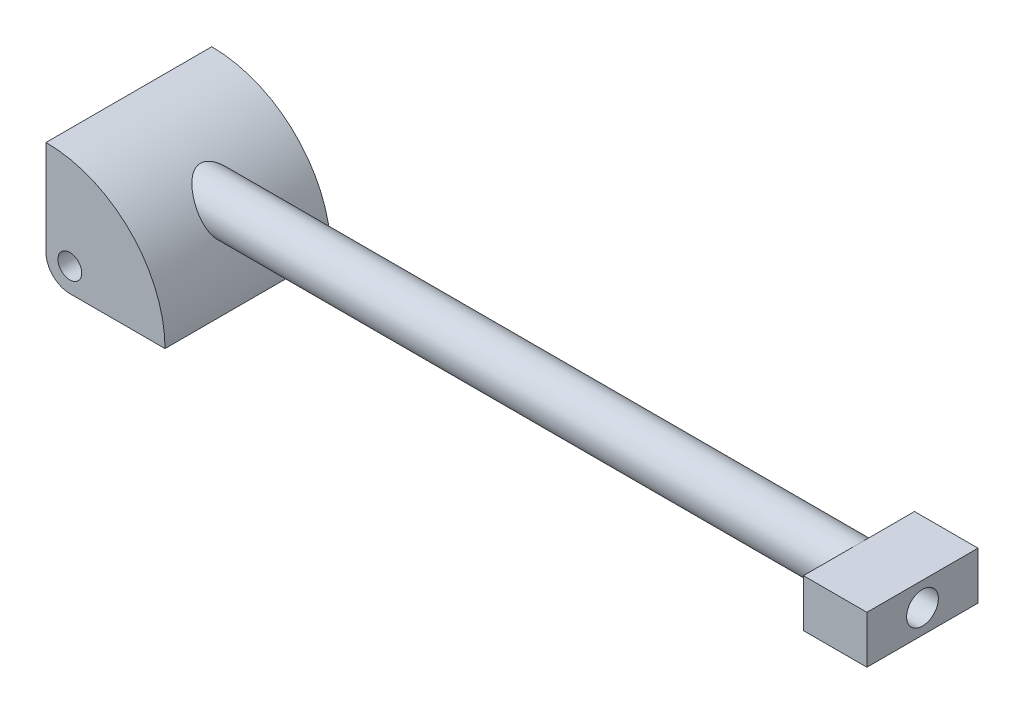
ISO-10303-21;
HEADER;
FILE_DESCRIPTION(('STEP AP214'),'2;1');
FILE_NAME('part.step','',(''),(''),'','','');
FILE_SCHEMA(('AUTOMOTIVE_DESIGN { 1 0 10303 214 1 1 1 1 }'));
ENDSEC;
DATA;
#1=APPLICATION_CONTEXT('core data for automotive mechanical design processes');
#2=APPLICATION_PROTOCOL_DEFINITION('international standard','automotive_design',2000,#1);
#3=PRODUCT_CONTEXT('',#1,'mechanical');
#4=PRODUCT('Part','Part','',(#3));
#5=PRODUCT_RELATED_PRODUCT_CATEGORY('part','',(#4));
#6=PRODUCT_DEFINITION_FORMATION('','',#4);
#7=PRODUCT_DEFINITION_CONTEXT('part definition',#1,'design');
#8=PRODUCT_DEFINITION('design','',#6,#7);
#9=PRODUCT_DEFINITION_SHAPE('','',#8);
#10=(LENGTH_UNIT() NAMED_UNIT(*) SI_UNIT(.MILLI.,.METRE.));
#11=(NAMED_UNIT(*) PLANE_ANGLE_UNIT() SI_UNIT($,.RADIAN.));
#12=(NAMED_UNIT(*) SI_UNIT($,.STERADIAN.) SOLID_ANGLE_UNIT());
#13=UNCERTAINTY_MEASURE_WITH_UNIT(LENGTH_MEASURE(1.E-05),#10,'distance_accuracy_value','');
#14=(GEOMETRIC_REPRESENTATION_CONTEXT(3) GLOBAL_UNCERTAINTY_ASSIGNED_CONTEXT((#13)) GLOBAL_UNIT_ASSIGNED_CONTEXT((#10,
#11,#12)) REPRESENTATION_CONTEXT('',''));
#15=CARTESIAN_POINT('',(0.,0.,0.));
#16=DIRECTION('',(0.,0.,1.));
#17=DIRECTION('',(1.,0.,0.));
#18=AXIS2_PLACEMENT_3D('',#15,#16,#17);
#19=CARTESIAN_POINT('',(615.95,38.1,-66.3321));
#20=DIRECTION('',(-1.,0.,0.));
#21=DIRECTION('',(0.,0.,1.));
#22=AXIS2_PLACEMENT_3D('',#19,#20,#21);
#23=CYLINDRICAL_SURFACE('',#22,19.05);
#24=CARTESIAN_POINT('',(57.1500000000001,38.1,-47.2821));
#25=CARTESIAN_POINT('',(57.637463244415,37.4500465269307,-47.2821025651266));
#26=CARTESIAN_POINT('',(58.1166334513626,36.7937865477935,-47.3153611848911));
#27=CARTESIAN_POINT('',(59.0549006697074,35.4737842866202,-47.4523218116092));
#28=CARTESIAN_POINT('',(59.5139889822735,34.8100389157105,-47.5560540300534));
#29=CARTESIAN_POINT('',(60.4080929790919,33.4820266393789,-47.8378552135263));
#30=CARTESIAN_POINT('',(60.8431158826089,32.8177599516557,-48.0159017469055));
#31=CARTESIAN_POINT('',(61.4745021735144,31.8275078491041,-48.341016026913));
#32=CARTESIAN_POINT('',(61.6814120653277,31.4984941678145,-48.4590409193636));
#33=CARTESIAN_POINT('',(62.087873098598,30.8434518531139,-48.7148175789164));
#34=CARTESIAN_POINT('',(62.287422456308,30.51742395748,-48.8525740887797));
#35=CARTESIAN_POINT('',(62.7629612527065,29.7300659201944,-49.2117572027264));
#36=CARTESIAN_POINT('',(63.0348347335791,29.2709733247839,-49.4436583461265));
#37=CARTESIAN_POINT('',(63.5610341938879,28.3657529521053,-49.9487086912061));
#38=CARTESIAN_POINT('',(63.8153641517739,27.9196222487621,-50.221848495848));
#39=CARTESIAN_POINT('',(64.3051838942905,27.0447608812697,-50.8091636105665));
#40=CARTESIAN_POINT('',(64.5406851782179,26.6160196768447,-51.1233135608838));
#41=CARTESIAN_POINT('',(64.9919109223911,25.7801831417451,-51.7921177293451));
#42=CARTESIAN_POINT('',(65.2076347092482,25.3730885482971,-52.1467733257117));
#43=CARTESIAN_POINT('',(65.6194560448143,24.5830754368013,-52.8973057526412));
#44=CARTESIAN_POINT('',(65.8154398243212,24.2003012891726,-53.2933973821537));
#45=CARTESIAN_POINT('',(66.185619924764,23.4661226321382,-54.1231287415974));
#46=CARTESIAN_POINT('',(66.3598159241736,23.1147185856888,-54.556769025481));
#47=CARTESIAN_POINT('',(66.685765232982,22.4479376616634,-55.4587407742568));
#48=CARTESIAN_POINT('',(66.8375212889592,22.132556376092,-55.9270679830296));
#49=CARTESIAN_POINT('',(67.1181511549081,21.5421070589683,-56.8949425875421));
#50=CARTESIAN_POINT('',(67.2470272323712,21.2670350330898,-57.3944868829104));
#51=CARTESIAN_POINT('',(67.4704326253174,20.7851718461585,-58.3717494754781));
#52=CARTESIAN_POINT('',(67.5670639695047,20.5743729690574,-58.8470165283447));
#53=CARTESIAN_POINT('',(67.7412349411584,20.1914109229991,-59.8162431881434));
#54=CARTESIAN_POINT('',(67.8187757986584,20.019245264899,-60.3102015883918));
#55=CARTESIAN_POINT('',(67.9546805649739,19.7156516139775,-61.3128818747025));
#56=CARTESIAN_POINT('',(68.0130504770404,19.5842108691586,-61.8215990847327));
#57=CARTESIAN_POINT('',(68.1106214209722,19.3635804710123,-62.8499198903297));
#58=CARTESIAN_POINT('',(68.1498230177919,19.2743895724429,-63.3695231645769));
#59=CARTESIAN_POINT('',(68.2073909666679,19.1431280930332,-64.3860212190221));
#60=CARTESIAN_POINT('',(68.2268034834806,19.0986932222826,-64.8825531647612));
#61=CARTESIAN_POINT('',(68.2485525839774,19.0488972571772,-65.8779321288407));
#62=CARTESIAN_POINT('',(68.2508899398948,19.0435343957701,-66.3767790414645));
#63=CARTESIAN_POINT('',(68.2384911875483,19.0719364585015,-67.3730727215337));
#64=CARTESIAN_POINT('',(68.223757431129,19.1056959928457,-67.870519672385));
#65=CARTESIAN_POINT('',(68.1772185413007,19.2119680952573,-68.8604512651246));
#66=CARTESIAN_POINT('',(68.1454133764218,19.2844807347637,-69.3529358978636));
#67=CARTESIAN_POINT('',(68.0653080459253,19.4661692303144,-70.3224146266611));
#68=CARTESIAN_POINT('',(68.0172492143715,19.5748083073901,-70.7995294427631));
#69=CARTESIAN_POINT('',(67.904558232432,19.8278402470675,-71.7421665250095));
#70=CARTESIAN_POINT('',(67.8399263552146,19.9722325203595,-72.2076889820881));
#71=CARTESIAN_POINT('',(67.694128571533,20.2952669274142,-73.1240050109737));
#72=CARTESIAN_POINT('',(67.6129631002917,20.4739081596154,-73.5747989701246));
#73=CARTESIAN_POINT('',(67.4341739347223,20.8636077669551,-74.4587602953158));
#74=CARTESIAN_POINT('',(67.3365499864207,21.0746666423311,-74.891927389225));
#75=CARTESIAN_POINT('',(67.1232463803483,21.5307649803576,-75.7448916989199));
#76=CARTESIAN_POINT('',(67.0072977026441,21.7763034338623,-76.1643546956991));
#77=CARTESIAN_POINT('',(66.7587505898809,22.2961459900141,-76.979847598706));
#78=CARTESIAN_POINT('',(66.6261520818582,22.5704502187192,-77.3758774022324));
#79=CARTESIAN_POINT('',(66.3445938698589,23.1451204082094,-78.1424155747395));
#80=CARTESIAN_POINT('',(66.1956329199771,23.4454883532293,-78.5129219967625));
#81=CARTESIAN_POINT('',(65.8817510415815,24.0693934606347,-79.2266442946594));
#82=CARTESIAN_POINT('',(65.7168296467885,24.3929312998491,-79.5698593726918));
#83=CARTESIAN_POINT('',(65.3624696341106,25.0776977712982,-80.2448715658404));
#84=CARTESIAN_POINT('',(65.1721994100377,25.4400129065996,-80.5751297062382));
#85=CARTESIAN_POINT('',(64.7752077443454,26.1835567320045,-81.2027967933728));
#86=CARTESIAN_POINT('',(64.5684858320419,26.5647859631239,-81.5002047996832));
#87=CARTESIAN_POINT('',(64.1393438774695,27.3428112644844,-82.061548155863));
#88=CARTESIAN_POINT('',(63.9169213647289,27.7396097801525,-82.3254782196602));
#89=CARTESIAN_POINT('',(63.4572610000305,28.5454789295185,-82.8195824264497));
#90=CARTESIAN_POINT('',(63.2200214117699,28.9545509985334,-83.0497526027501));
#91=CARTESIAN_POINT('',(62.7069692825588,29.8237162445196,-83.4980044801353));
#92=CARTESIAN_POINT('',(62.4296823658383,30.284784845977,-83.7125084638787));
#93=CARTESIAN_POINT('',(61.8596197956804,31.2142339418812,-84.1012456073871));
#94=CARTESIAN_POINT('',(61.5668432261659,31.6826148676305,-84.2754763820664));
#95=CARTESIAN_POINT('',(60.9670505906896,32.6234501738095,-84.5846392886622));
#96=CARTESIAN_POINT('',(60.6600289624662,33.0959060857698,-84.7195559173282));
#97=CARTESIAN_POINT('',(60.0332097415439,34.0417171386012,-84.951174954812));
#98=CARTESIAN_POINT('',(59.7134108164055,34.5150723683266,-85.0478733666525));
#99=CARTESIAN_POINT('',(59.0119364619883,35.5332901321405,-85.2164976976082));
#100=CARTESIAN_POINT('',(58.628353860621,36.0778628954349,-85.2822599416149));
#101=CARTESIAN_POINT('',(57.8480515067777,37.1611909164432,-85.3667106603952));
#102=CARTESIAN_POINT('',(57.4513305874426,37.6999456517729,-85.385394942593));
#103=CARTESIAN_POINT('',(56.6467585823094,38.7687745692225,-85.3778574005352));
#104=CARTESIAN_POINT('',(56.2389067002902,39.2988481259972,-85.3516323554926));
#105=CARTESIAN_POINT('',(55.4140753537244,40.3478901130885,-85.2563417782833));
#106=CARTESIAN_POINT('',(54.9970954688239,40.8668580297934,-85.1872742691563));
#107=CARTESIAN_POINT('',(54.077379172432,41.9874277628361,-84.9914552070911));
#108=CARTESIAN_POINT('',(53.5731667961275,42.5863674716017,-84.8563414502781));
#109=CARTESIAN_POINT('',(52.5578218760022,43.7631078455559,-84.5311229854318));
#110=CARTESIAN_POINT('',(52.04668848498,44.3409058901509,-84.3410114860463));
#111=CARTESIAN_POINT('',(51.0196000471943,45.4744136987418,-83.9073573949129));
#112=CARTESIAN_POINT('',(50.5036362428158,46.030065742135,-83.663684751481));
#113=CARTESIAN_POINT('',(49.4717378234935,47.1156620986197,-83.1245875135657));
#114=CARTESIAN_POINT('',(48.955803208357,47.6456066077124,-82.8291633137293));
#115=CARTESIAN_POINT('',(47.8531516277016,48.7528508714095,-82.1404570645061));
#116=CARTESIAN_POINT('',(47.2670562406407,49.3258245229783,-81.7391912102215));
#117=CARTESIAN_POINT('',(46.1069457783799,50.4322067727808,-80.8687754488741));
#118=CARTESIAN_POINT('',(45.5329366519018,50.9655961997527,-80.3995929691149));
#119=CARTESIAN_POINT('',(44.6894285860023,51.7312961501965,-79.6444280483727));
#120=CARTESIAN_POINT('',(44.4115821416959,51.9804493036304,-79.3845709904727));
#121=CARTESIAN_POINT('',(43.8627897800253,52.466974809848,-78.847050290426));
#122=CARTESIAN_POINT('',(43.5918439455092,52.7043470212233,-78.5693864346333));
#123=CARTESIAN_POINT('',(43.058881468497,53.1661586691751,-77.9960916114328));
#124=CARTESIAN_POINT('',(42.7968554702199,53.3906118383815,-77.7004804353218));
#125=CARTESIAN_POINT('',(42.2834629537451,53.8257986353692,-77.0904518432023));
#126=CARTESIAN_POINT('',(42.0320961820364,54.0365325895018,-76.7760348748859));
#127=CARTESIAN_POINT('',(41.5526453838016,54.4345213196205,-76.1412965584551));
#128=CARTESIAN_POINT('',(41.3240278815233,54.622387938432,-75.8217638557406));
#129=CARTESIAN_POINT('',(40.8813918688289,54.982913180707,-75.1644408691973));
#130=CARTESIAN_POINT('',(40.6673735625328,55.1555715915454,-74.8266503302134));
#131=CARTESIAN_POINT('',(40.257228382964,55.483778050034,-74.1329845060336));
#132=CARTESIAN_POINT('',(40.0610799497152,55.6393467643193,-73.7771318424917));
#133=CARTESIAN_POINT('',(39.6898965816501,55.931616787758,-73.0470447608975));
#134=CARTESIAN_POINT('',(39.5148600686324,56.0683195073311,-72.6728117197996));
#135=CARTESIAN_POINT('',(39.2171243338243,56.2994132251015,-71.9709408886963));
#136=CARTESIAN_POINT('',(39.0905705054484,56.3970555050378,-71.6460106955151));
#137=CARTESIAN_POINT('',(38.8573163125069,56.5762312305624,-70.9849030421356));
#138=CARTESIAN_POINT('',(38.7506061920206,56.6577725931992,-70.6487312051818));
#139=CARTESIAN_POINT('',(38.5594529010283,56.8033314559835,-69.96657721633));
#140=CARTESIAN_POINT('',(38.4749967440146,56.8673591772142,-69.6206009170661));
#141=CARTESIAN_POINT('',(38.3304939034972,56.9766378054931,-68.9206298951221));
#142=CARTESIAN_POINT('',(38.2704469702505,57.0218889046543,-68.5666352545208));
#143=CARTESIAN_POINT('',(38.1761985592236,57.0928147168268,-67.850597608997));
#144=CARTESIAN_POINT('',(38.1421883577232,57.1183445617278,-67.488514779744));
#145=CARTESIAN_POINT('',(38.101844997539,57.1486204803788,-66.7619299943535));
#146=CARTESIAN_POINT('',(38.0955117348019,57.1533666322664,-66.397428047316));
#147=CARTESIAN_POINT('',(38.1107339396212,57.1419489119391,-65.6693327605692));
#148=CARTESIAN_POINT('',(38.1322903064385,57.125784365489,-65.3057394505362));
#149=CARTESIAN_POINT('',(38.2025805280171,57.0729691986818,-64.5827214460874));
#150=CARTESIAN_POINT('',(38.2513135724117,57.0363191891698,-64.2232966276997));
#151=CARTESIAN_POINT('',(38.367751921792,56.9484798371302,-63.5500490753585));
#152=CARTESIAN_POINT('',(38.4328323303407,56.8992939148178,-63.2355017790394));
#153=CARTESIAN_POINT('',(38.5819320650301,56.7862159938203,-62.6135278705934));
#154=CARTESIAN_POINT('',(38.6659580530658,56.722318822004,-62.3061038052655));
#155=CARTESIAN_POINT('',(38.8512478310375,56.5808241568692,-61.6997602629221));
#156=CARTESIAN_POINT('',(38.952511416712,56.503226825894,-61.4008406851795));
#157=CARTESIAN_POINT('',(39.1705229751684,56.3353576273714,-60.8123244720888));
#158=CARTESIAN_POINT('',(39.2872748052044,56.2450826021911,-60.5227301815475));
#159=CARTESIAN_POINT('',(39.604523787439,55.9984468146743,-59.7922641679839));
#160=CARTESIAN_POINT('',(39.8150147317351,55.8336045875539,-59.3585569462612));
#161=CARTESIAN_POINT('',(40.2635003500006,55.4788733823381,-58.5163262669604));
#162=CARTESIAN_POINT('',(40.5015083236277,55.2889722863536,-58.1078151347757));
#163=CARTESIAN_POINT('',(41.0002433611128,54.8866865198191,-57.3150215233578));
#164=CARTESIAN_POINT('',(41.2610239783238,54.6742485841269,-56.9308000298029));
#165=CARTESIAN_POINT('',(41.8003113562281,54.2297677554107,-56.1871134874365));
#166=CARTESIAN_POINT('',(42.0788177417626,53.9977252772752,-55.8276479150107));
#167=CARTESIAN_POINT('',(42.7958078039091,53.3929184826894,-54.9550410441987));
#168=CARTESIAN_POINT('',(43.2433568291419,53.0088048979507,-54.457165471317));
#169=CARTESIAN_POINT('',(44.1608746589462,52.2053182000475,-53.5130947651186));
#170=CARTESIAN_POINT('',(44.630854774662,51.7859272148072,-53.0669261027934));
#171=CARTESIAN_POINT('',(45.5863960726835,50.9151137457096,-52.2238410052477));
#172=CARTESIAN_POINT('',(46.0719748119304,50.4636544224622,-51.8269827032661));
#173=CARTESIAN_POINT('',(47.0524371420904,49.5319780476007,-51.0819173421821));
#174=CARTESIAN_POINT('',(47.5473191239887,49.0517659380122,-50.7337019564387));
#175=CARTESIAN_POINT('',(48.5613532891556,48.0454344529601,-50.0727275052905));
#176=CARTESIAN_POINT('',(49.0806993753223,47.5182551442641,-49.7618805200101));
#177=CARTESIAN_POINT('',(50.1204409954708,46.4372137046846,-49.192479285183));
#178=CARTESIAN_POINT('',(50.6408366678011,45.883347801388,-48.9339324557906));
#179=CARTESIAN_POINT('',(51.6775798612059,44.752499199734,-48.4709946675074));
#180=CARTESIAN_POINT('',(52.1939341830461,44.1755765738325,-48.2664723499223));
#181=CARTESIAN_POINT('',(53.2202557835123,42.9998291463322,-47.912792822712));
#182=CARTESIAN_POINT('',(53.7302252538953,42.401012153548,-47.7636160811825));
#183=CARTESIAN_POINT('',(54.7322169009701,41.1941016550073,-47.525158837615));
#184=CARTESIAN_POINT('',(55.2243965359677,40.5863289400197,-47.434921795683));
#185=CARTESIAN_POINT('',(56.1969926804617,39.3543596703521,-47.3133547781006));
#186=CARTESIAN_POINT('',(56.6773939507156,38.7301438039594,-47.2820975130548));
#187=CARTESIAN_POINT('',(57.1500000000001,38.1,-47.2821));
#188=B_SPLINE_CURVE_WITH_KNOTS('',3,(#24,#25,#26,#27,#28,#29,#30,#31,#32,#33,#34,#35,#36,#37,
#38,#39,#40,#41,#42,#43,#44,#45,#46,#47,#48,#49,#50,#51,#52,#53,#54,#55,#56,#57,#58,#59,#60,#61,
#62,#63,#64,#65,#66,#67,#68,#69,#70,#71,#72,#73,#74,#75,#76,#77,#78,#79,#80,#81,#82,#83,#84,#85,
#86,#87,#88,#89,#90,#91,#92,#93,#94,#95,#96,#97,#98,#99,#100,#101,#102,#103,#104,#105,#106,#107,
#108,#109,#110,#111,#112,#113,#114,#115,#116,#117,#118,#119,#120,#121,#122,#123,#124,#125,#126,
#127,#128,#129,#130,#131,#132,#133,#134,#135,#136,#137,#138,#139,#140,#141,#142,#143,#144,#145,
#146,#147,#148,#149,#150,#151,#152,#153,#154,#155,#156,#157,#158,#159,#160,#161,#162,#163,#164,
#165,#166,#167,#168,#169,#170,#171,#172,#173,#174,#175,#176,#177,#178,#179,#180,#181,#182,#183,
#184,#185,#186,#187),.UNSPECIFIED.,.T.,.F.,(4,2,2,2,2,2,2,2,2,2,2,2,2,2,2,2,2,2,2,2,2,2,2,2,2,2,
2,2,2,2,2,2,2,2,2,2,2,2,2,2,2,2,2,2,2,2,2,2,2,2,2,2,2,2,2,2,2,2,2,2,2,2,2,2,2,2,2,2,2,2,2,2,2,2,
2,2,2,2,2,2,2,4),(0.,2.43658157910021,4.87420836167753,7.31109988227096,8.5292041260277,
9.74760165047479,11.4910410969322,13.2340838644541,14.9760538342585,16.7180830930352,
18.4696380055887,20.2212187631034,21.9725849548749,23.7237774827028,25.3082161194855,
26.892552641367,28.476392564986,30.0601858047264,31.5550624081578,33.0498714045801,
34.5444744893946,36.0390803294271,37.5124033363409,38.9857020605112,40.4589620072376,
41.9322446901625,43.4296062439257,44.9269743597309,46.424456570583,47.9219825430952,
49.4979247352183,51.0739120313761,52.6501478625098,54.2265687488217,55.96244521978,
57.6984244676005,59.4350873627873,61.1719318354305,63.1780112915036,65.1842693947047,
67.19067138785,69.1971659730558,71.5782775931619,73.9596833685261,76.3469365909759,
78.7341716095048,81.4686875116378,84.2045192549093,85.5683337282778,86.9321645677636,
88.2945178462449,89.6568387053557,90.9625335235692,92.2682465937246,93.5723628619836,
94.8763815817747,95.9617666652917,97.0466167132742,98.1308322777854,99.2150367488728,
100.307131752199,101.399222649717,102.491348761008,103.583442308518,104.55731331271,
105.531527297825,106.505729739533,107.480175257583,109.006235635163,110.533036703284,
112.063530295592,113.593991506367,115.906016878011,118.219220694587,120.535126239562,
122.850634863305,125.256435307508,127.662576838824,130.062812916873,132.462201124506,
134.821612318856,137.18393031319),.UNSPECIFIED.);
#189=CARTESIAN_POINT('',(57.1500000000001,38.1,-47.2821));
#190=VERTEX_POINT('',#189);
#191=EDGE_CURVE('E187',#190,#190,#188,.T.);
#192=ORIENTED_EDGE('',*,*,#191,.T.);
#193=EDGE_LOOP('',(#192));
#194=FACE_BOUND('',#193,.T.);
#195=CARTESIAN_POINT('',(565.15,38.1,-66.3321));
#196=DIRECTION('',(1.,0.,0.));
#197=DIRECTION('',(0.,0.,-1.));
#198=AXIS2_PLACEMENT_3D('',#195,#196,#197);
#199=CIRCLE('',#198,19.05);
#200=CARTESIAN_POINT('',(565.15,57.15,-66.3321));
#201=VERTEX_POINT('',#200);
#202=CARTESIAN_POINT('',(565.15,19.05,-66.3321));
#203=VERTEX_POINT('',#202);
#204=EDGE_CURVE('E37',#201,#203,#199,.F.);
#205=ORIENTED_EDGE('',*,*,#204,.T.);
#206=EDGE_CURVE('E12',#203,#201,#199,.F.);
#207=ORIENTED_EDGE('',*,*,#206,.T.);
#208=EDGE_LOOP('',(#205,#207));
#209=FACE_BOUND('',#208,.T.);
#210=ADVANCED_FACE('F33',(#194,#209),#23,.T.);
#211=CARTESIAN_POINT('',(0.,0.,-132.6642));
#212=DIRECTION('',(0.,0.,1.));
#213=DIRECTION('',(1.,0.,0.));
#214=AXIS2_PLACEMENT_3D('',#211,#212,#213);
#215=CYLINDRICAL_SURFACE('',#214,19.05);
#216=CARTESIAN_POINT('',(0.,0.,0.));
#217=DIRECTION('',(0.,0.,1.));
#218=DIRECTION('',(1.,0.,0.));
#219=AXIS2_PLACEMENT_3D('',#216,#217,#218);
#220=CIRCLE('',#219,19.05);
#221=CARTESIAN_POINT('',(-19.05,0.,0.));
#222=VERTEX_POINT('',#221);
#223=CARTESIAN_POINT('',(0.,-19.05,0.));
#224=VERTEX_POINT('',#223);
#225=EDGE_CURVE('E163',#222,#224,#220,.T.);
#226=ORIENTED_EDGE('',*,*,#225,.F.);
#227=DIRECTION('',(0.,0.,1.));
#228=VECTOR('',#227,1.);
#229=CARTESIAN_POINT('',(-19.05,0.,-132.6642));
#230=LINE('',#229,#228);
#231=CARTESIAN_POINT('',(-19.05,0.,-132.6642));
#232=VERTEX_POINT('',#231);
#233=EDGE_CURVE('E57',#232,#222,#230,.T.);
#234=ORIENTED_EDGE('',*,*,#233,.F.);
#235=CARTESIAN_POINT('',(0.,0.,-132.6642));
#236=DIRECTION('',(0.,0.,1.));
#237=DIRECTION('',(1.,0.,0.));
#238=AXIS2_PLACEMENT_3D('',#235,#236,#237);
#239=CIRCLE('',#238,19.05);
#240=CARTESIAN_POINT('',(0.,-19.05,-132.6642));
#241=VERTEX_POINT('',#240);
#242=EDGE_CURVE('E166',#232,#241,#239,.T.);
#243=ORIENTED_EDGE('',*,*,#242,.T.);
#244=DIRECTION('',(0.,0.,1.));
#245=VECTOR('',#244,1.);
#246=CARTESIAN_POINT('',(0.,-19.05,-132.6642));
#247=LINE('',#246,#245);
#248=EDGE_CURVE('E83',#241,#224,#247,.T.);
#249=ORIENTED_EDGE('',*,*,#248,.T.);
#250=EDGE_LOOP('',(#226,#234,#243,#249));
#251=FACE_BOUND('',#250,.T.);
#252=ADVANCED_FACE('F35',(#251),#215,.T.);
#253=CARTESIAN_POINT('',(-19.05,0.,-132.6642));
#254=DIRECTION('',(-1.,0.,0.));
#255=DIRECTION('',(0.,0.,1.));
#256=AXIS2_PLACEMENT_3D('',#253,#254,#255);
#257=PLANE('',#256);
#258=DIRECTION('',(0.,-1.,0.));
#259=VECTOR('',#258,1.);
#260=CARTESIAN_POINT('',(-19.05,0.,0.));
#261=LINE('',#260,#259);
#262=CARTESIAN_POINT('',(-19.05,76.2,0.));
#263=VERTEX_POINT('',#262);
#264=EDGE_CURVE('E169',#263,#222,#261,.T.);
#265=ORIENTED_EDGE('',*,*,#264,.F.);
#266=DIRECTION('',(0.,0.,1.));
#267=VECTOR('',#266,1.);
#268=CARTESIAN_POINT('',(-19.05,76.2,-132.6642));
#269=LINE('',#268,#267);
#270=CARTESIAN_POINT('',(-19.05,76.2,-132.6642));
#271=VERTEX_POINT('',#270);
#272=EDGE_CURVE('E188',#271,#263,#269,.T.);
#273=ORIENTED_EDGE('',*,*,#272,.F.);
#274=DIRECTION('',(0.,-1.,0.));
#275=VECTOR('',#274,1.);
#276=CARTESIAN_POINT('',(-19.05,0.,-132.6642));
#277=LINE('',#276,#275);
#278=EDGE_CURVE('E174',#271,#232,#277,.T.);
#279=ORIENTED_EDGE('',*,*,#278,.T.);
#280=ORIENTED_EDGE('',*,*,#233,.T.);
#281=EDGE_LOOP('',(#265,#273,#279,#280));
#282=FACE_BOUND('',#281,.T.);
#283=ADVANCED_FACE('F219',(#282),#257,.T.);
#284=CARTESIAN_POINT('',(-19.05,-19.05,-132.6642));
#285=DIRECTION('',(0.,0.,1.));
#286=DIRECTION('',(1.,0.,0.));
#287=AXIS2_PLACEMENT_3D('',#284,#285,#286);
#288=CYLINDRICAL_SURFACE('',#287,95.25);
#289=ORIENTED_EDGE('',*,*,#191,.F.);
#290=EDGE_LOOP('',(#289));
#291=FACE_BOUND('',#290,.T.);
#292=CARTESIAN_POINT('',(-19.05,-19.05,0.));
#293=DIRECTION('',(0.,0.,1.));
#294=DIRECTION('',(-1.,0.,0.));
#295=AXIS2_PLACEMENT_3D('',#292,#293,#294);
#296=CIRCLE('',#295,95.25);
#297=CARTESIAN_POINT('',(76.2,-19.05,0.));
#298=VERTEX_POINT('',#297);
#299=EDGE_CURVE('E181',#298,#263,#296,.T.);
#300=ORIENTED_EDGE('',*,*,#299,.F.);
#301=DIRECTION('',(0.,0.,1.));
#302=VECTOR('',#301,1.);
#303=CARTESIAN_POINT('',(76.2,-19.05,-132.6642));
#304=LINE('',#303,#302);
#305=CARTESIAN_POINT('',(76.2,-19.05,-132.6642));
#306=VERTEX_POINT('',#305);
#307=EDGE_CURVE('E190',#306,#298,#304,.T.);
#308=ORIENTED_EDGE('',*,*,#307,.F.);
#309=CARTESIAN_POINT('',(-19.05,-19.05,-132.6642));
#310=DIRECTION('',(0.,0.,1.));
#311=DIRECTION('',(-1.,0.,0.));
#312=AXIS2_PLACEMENT_3D('',#309,#310,#311);
#313=CIRCLE('',#312,95.25);
#314=EDGE_CURVE('E171',#306,#271,#313,.T.);
#315=ORIENTED_EDGE('',*,*,#314,.T.);
#316=ORIENTED_EDGE('',*,*,#272,.T.);
#317=EDGE_LOOP('',(#300,#308,#315,#316));
#318=FACE_BOUND('',#317,.T.);
#319=ADVANCED_FACE('F197',(#291,#318),#288,.T.);
#320=CARTESIAN_POINT('',(0.,-19.05,-132.6642));
#321=DIRECTION('',(0.,-1.,0.));
#322=DIRECTION('',(0.,0.,-1.));
#323=AXIS2_PLACEMENT_3D('',#320,#321,#322);
#324=PLANE('',#323);
#325=DIRECTION('',(1.,0.,0.));
#326=VECTOR('',#325,1.);
#327=CARTESIAN_POINT('',(0.,-19.05,0.));
#328=LINE('',#327,#326);
#329=EDGE_CURVE('E178',#224,#298,#328,.T.);
#330=ORIENTED_EDGE('',*,*,#329,.F.);
#331=ORIENTED_EDGE('',*,*,#248,.F.);
#332=DIRECTION('',(1.,0.,0.));
#333=VECTOR('',#332,1.);
#334=CARTESIAN_POINT('',(0.,-19.05,-132.6642));
#335=LINE('',#334,#333);
#336=EDGE_CURVE('E168',#241,#306,#335,.T.);
#337=ORIENTED_EDGE('',*,*,#336,.T.);
#338=ORIENTED_EDGE('',*,*,#307,.T.);
#339=EDGE_LOOP('',(#330,#331,#337,#338));
#340=FACE_BOUND('',#339,.T.);
#341=ADVANCED_FACE('F215',(#340),#324,.T.);
#342=CARTESIAN_POINT('',(0.,0.,-132.6642));
#343=DIRECTION('',(0.,0.,1.));
#344=DIRECTION('',(1.,0.,0.));
#345=AXIS2_PLACEMENT_3D('',#342,#343,#344);
#346=PLANE('',#345);
#347=CARTESIAN_POINT('',(0.,0.,-132.6642));
#348=DIRECTION('',(0.,0.,1.));
#349=DIRECTION('',(1.,0.,0.));
#350=AXIS2_PLACEMENT_3D('',#347,#348,#349);
#351=CIRCLE('',#350,9.525);
#352=CARTESIAN_POINT('',(9.525,0.,-132.6642));
#353=VERTEX_POINT('',#352);
#354=EDGE_CURVE('E160',#353,#353,#351,.T.);
#355=ORIENTED_EDGE('',*,*,#354,.T.);
#356=EDGE_LOOP('',(#355));
#357=FACE_BOUND('',#356,.T.);
#358=ORIENTED_EDGE('',*,*,#242,.F.);
#359=ORIENTED_EDGE('',*,*,#278,.F.);
#360=ORIENTED_EDGE('',*,*,#314,.F.);
#361=ORIENTED_EDGE('',*,*,#336,.F.);
#362=EDGE_LOOP('',(#358,#359,#360,#361));
#363=FACE_BOUND('',#362,.T.);
#364=ADVANCED_FACE('F212',(#357,#363),#346,.F.);
#365=CARTESIAN_POINT('',(0.,0.,0.));
#366=DIRECTION('',(0.,0.,1.));
#367=DIRECTION('',(1.,0.,0.));
#368=AXIS2_PLACEMENT_3D('',#365,#366,#367);
#369=PLANE('',#368);
#370=CARTESIAN_POINT('',(0.,0.,0.));
#371=DIRECTION('',(0.,0.,1.));
#372=DIRECTION('',(1.,0.,0.));
#373=AXIS2_PLACEMENT_3D('',#370,#371,#372);
#374=CIRCLE('',#373,9.525);
#375=CARTESIAN_POINT('',(9.525,0.,0.));
#376=VERTEX_POINT('',#375);
#377=EDGE_CURVE('E155',#376,#376,#374,.T.);
#378=ORIENTED_EDGE('',*,*,#377,.F.);
#379=EDGE_LOOP('',(#378));
#380=FACE_BOUND('',#379,.T.);
#381=ORIENTED_EDGE('',*,*,#225,.T.);
#382=ORIENTED_EDGE('',*,*,#329,.T.);
#383=ORIENTED_EDGE('',*,*,#299,.T.);
#384=ORIENTED_EDGE('',*,*,#264,.T.);
#385=EDGE_LOOP('',(#381,#382,#383,#384));
#386=FACE_BOUND('',#385,.T.);
#387=ADVANCED_FACE('F210',(#380,#386),#369,.T.);
#388=CARTESIAN_POINT('',(0.,0.,-132.6642));
#389=DIRECTION('',(0.,0.,1.));
#390=DIRECTION('',(1.,0.,0.));
#391=AXIS2_PLACEMENT_3D('',#388,#389,#390);
#392=CYLINDRICAL_SURFACE('',#391,9.525);
#393=ORIENTED_EDGE('',*,*,#354,.F.);
#394=EDGE_LOOP('',(#393));
#395=FACE_BOUND('',#394,.T.);
#396=ORIENTED_EDGE('',*,*,#377,.T.);
#397=EDGE_LOOP('',(#396));
#398=FACE_BOUND('',#397,.T.);
#399=ADVANCED_FACE('F207',(#395,#398),#392,.F.);
#400=CARTESIAN_POINT('',(565.15,19.05,-21.8821));
#401=DIRECTION('',(1.,0.,0.));
#402=DIRECTION('',(0.,0.,-1.));
#403=AXIS2_PLACEMENT_3D('',#400,#401,#402);
#404=PLANE('',#403);
#405=ORIENTED_EDGE('',*,*,#206,.F.);
#406=DIRECTION('',(0.,0.,-1.));
#407=VECTOR('',#406,1.);
#408=CARTESIAN_POINT('',(565.15,19.05,-21.8821));
#409=LINE('',#408,#407);
#410=CARTESIAN_POINT('',(565.15,19.05,-21.8821));
#411=VERTEX_POINT('',#410);
#412=EDGE_CURVE('E48',#411,#203,#409,.T.);
#413=ORIENTED_EDGE('',*,*,#412,.F.);
#414=DIRECTION('',(0.,-1.,0.));
#415=VECTOR('',#414,1.);
#416=CARTESIAN_POINT('',(565.15,57.15,-21.8821));
#417=LINE('',#416,#415);
#418=CARTESIAN_POINT('',(565.15,57.15,-21.8821));
#419=VERTEX_POINT('',#418);
#420=EDGE_CURVE('E127',#419,#411,#417,.T.);
#421=ORIENTED_EDGE('',*,*,#420,.F.);
#422=DIRECTION('',(0.,0.,1.));
#423=VECTOR('',#422,1.);
#424=CARTESIAN_POINT('',(565.15,57.15,-21.8821));
#425=LINE('',#424,#423);
#426=EDGE_CURVE('E146',#201,#419,#425,.T.);
#427=ORIENTED_EDGE('',*,*,#426,.F.);
#428=EDGE_LOOP('',(#405,#413,#421,#427));
#429=FACE_BOUND('',#428,.T.);
#430=ADVANCED_FACE('F125',(#429),#404,.F.);
#431=CARTESIAN_POINT('',(565.15,57.15,-21.8821));
#432=DIRECTION('',(0.,1.,0.));
#433=DIRECTION('',(0.,0.,1.));
#434=AXIS2_PLACEMENT_3D('',#431,#432,#433);
#435=PLANE('',#434);
#436=DIRECTION('',(0.,0.,1.));
#437=VECTOR('',#436,1.);
#438=CARTESIAN_POINT('',(615.95,57.15,-21.8821));
#439=LINE('',#438,#437);
#440=CARTESIAN_POINT('',(615.95,57.15,-110.7821));
#441=VERTEX_POINT('',#440);
#442=CARTESIAN_POINT('',(615.95,57.15,-21.8821));
#443=VERTEX_POINT('',#442);
#444=EDGE_CURVE('E136',#441,#443,#439,.T.);
#445=ORIENTED_EDGE('',*,*,#444,.F.);
#446=DIRECTION('',(1.,0.,0.));
#447=VECTOR('',#446,1.);
#448=CARTESIAN_POINT('',(565.15,57.15,-110.7821));
#449=LINE('',#448,#447);
#450=CARTESIAN_POINT('',(565.15,57.15,-110.7821));
#451=VERTEX_POINT('',#450);
#452=EDGE_CURVE('E156',#451,#441,#449,.T.);
#453=ORIENTED_EDGE('',*,*,#452,.F.);
#454=EDGE_CURVE('E120',#451,#201,#425,.T.);
#455=ORIENTED_EDGE('',*,*,#454,.T.);
#456=ORIENTED_EDGE('',*,*,#426,.T.);
#457=DIRECTION('',(1.,0.,0.));
#458=VECTOR('',#457,1.);
#459=CARTESIAN_POINT('',(565.15,57.15,-21.8821));
#460=LINE('',#459,#458);
#461=EDGE_CURVE('E135',#419,#443,#460,.T.);
#462=ORIENTED_EDGE('',*,*,#461,.T.);
#463=EDGE_LOOP('',(#445,#453,#455,#456,#462));
#464=FACE_BOUND('',#463,.T.);
#465=ADVANCED_FACE('F256',(#464),#435,.T.);
#466=CARTESIAN_POINT('',(565.15,19.05,-21.8821));
#467=DIRECTION('',(0.,-1.,0.));
#468=DIRECTION('',(0.,0.,-1.));
#469=AXIS2_PLACEMENT_3D('',#466,#467,#468);
#470=PLANE('',#469);
#471=DIRECTION('',(1.,0.,0.));
#472=VECTOR('',#471,1.);
#473=CARTESIAN_POINT('',(565.15,19.05,-110.7821));
#474=LINE('',#473,#472);
#475=CARTESIAN_POINT('',(565.15,19.05,-110.7821));
#476=VERTEX_POINT('',#475);
#477=CARTESIAN_POINT('',(615.95,19.05,-110.7821));
#478=VERTEX_POINT('',#477);
#479=EDGE_CURVE('E119',#476,#478,#474,.T.);
#480=ORIENTED_EDGE('',*,*,#479,.T.);
#481=DIRECTION('',(0.,0.,-1.));
#482=VECTOR('',#481,1.);
#483=CARTESIAN_POINT('',(615.95,19.05,-21.8821));
#484=LINE('',#483,#482);
#485=CARTESIAN_POINT('',(615.95,19.05,-21.8821));
#486=VERTEX_POINT('',#485);
#487=EDGE_CURVE('E114',#486,#478,#484,.T.);
#488=ORIENTED_EDGE('',*,*,#487,.F.);
#489=DIRECTION('',(1.,0.,0.));
#490=VECTOR('',#489,1.);
#491=CARTESIAN_POINT('',(565.15,19.05,-21.8821));
#492=LINE('',#491,#490);
#493=EDGE_CURVE('E111',#411,#486,#492,.T.);
#494=ORIENTED_EDGE('',*,*,#493,.F.);
#495=ORIENTED_EDGE('',*,*,#412,.T.);
#496=EDGE_CURVE('E130',#203,#476,#409,.T.);
#497=ORIENTED_EDGE('',*,*,#496,.T.);
#498=EDGE_LOOP('',(#480,#488,#494,#495,#497));
#499=FACE_BOUND('',#498,.T.);
#500=ADVANCED_FACE('F113',(#499),#470,.T.);
#501=CARTESIAN_POINT('',(565.15,57.15,-21.8821));
#502=DIRECTION('',(0.,0.,1.));
#503=DIRECTION('',(1.,0.,0.));
#504=AXIS2_PLACEMENT_3D('',#501,#502,#503);
#505=PLANE('',#504);
#506=DIRECTION('',(0.,-1.,0.));
#507=VECTOR('',#506,1.);
#508=CARTESIAN_POINT('',(615.95,57.15,-21.8821));
#509=LINE('',#508,#507);
#510=EDGE_CURVE('E149',#443,#486,#509,.T.);
#511=ORIENTED_EDGE('',*,*,#510,.F.);
#512=ORIENTED_EDGE('',*,*,#461,.F.);
#513=ORIENTED_EDGE('',*,*,#420,.T.);
#514=ORIENTED_EDGE('',*,*,#493,.T.);
#515=EDGE_LOOP('',(#511,#512,#513,#514));
#516=FACE_BOUND('',#515,.T.);
#517=ADVANCED_FACE('F133',(#516),#505,.T.);
#518=CARTESIAN_POINT('',(565.15,57.15,-110.7821));
#519=DIRECTION('',(0.,0.,-1.));
#520=DIRECTION('',(-1.,0.,0.));
#521=AXIS2_PLACEMENT_3D('',#518,#519,#520);
#522=PLANE('',#521);
#523=DIRECTION('',(0.,1.,0.));
#524=VECTOR('',#523,1.);
#525=CARTESIAN_POINT('',(615.95,57.15,-110.7821));
#526=LINE('',#525,#524);
#527=EDGE_CURVE('E138',#478,#441,#526,.T.);
#528=ORIENTED_EDGE('',*,*,#527,.F.);
#529=ORIENTED_EDGE('',*,*,#479,.F.);
#530=DIRECTION('',(0.,1.,0.));
#531=VECTOR('',#530,1.);
#532=CARTESIAN_POINT('',(565.15,57.15,-110.7821));
#533=LINE('',#532,#531);
#534=EDGE_CURVE('E129',#476,#451,#533,.T.);
#535=ORIENTED_EDGE('',*,*,#534,.T.);
#536=ORIENTED_EDGE('',*,*,#452,.T.);
#537=EDGE_LOOP('',(#528,#529,#535,#536));
#538=FACE_BOUND('',#537,.T.);
#539=ADVANCED_FACE('F278',(#538),#522,.T.);
#540=ORIENTED_EDGE('',*,*,#204,.F.);
#541=ORIENTED_EDGE('',*,*,#454,.F.);
#542=ORIENTED_EDGE('',*,*,#534,.F.);
#543=ORIENTED_EDGE('',*,*,#496,.F.);
#544=EDGE_LOOP('',(#540,#541,#542,#543));
#545=FACE_BOUND('',#544,.T.);
#546=ADVANCED_FACE('F258',(#545),#404,.F.);
#547=CARTESIAN_POINT('',(615.95,38.1,-66.3321));
#548=DIRECTION('',(-1.,0.,0.));
#549=DIRECTION('',(0.,0.,1.));
#550=AXIS2_PLACEMENT_3D('',#547,#548,#549);
#551=PLANE('',#550);
#552=CARTESIAN_POINT('',(615.95,38.1,-66.3321));
#553=DIRECTION('',(1.,0.,0.));
#554=DIRECTION('',(0.,0.,-1.));
#555=AXIS2_PLACEMENT_3D('',#552,#553,#554);
#556=CIRCLE('',#555,12.7);
#557=CARTESIAN_POINT('',(615.95,38.1,-79.0321));
#558=VERTEX_POINT('',#557);
#559=EDGE_CURVE('E365',#558,#558,#556,.T.);
#560=ORIENTED_EDGE('',*,*,#559,.F.);
#561=EDGE_LOOP('',(#560));
#562=FACE_BOUND('',#561,.T.);
#563=ORIENTED_EDGE('',*,*,#527,.T.);
#564=ORIENTED_EDGE('',*,*,#444,.T.);
#565=ORIENTED_EDGE('',*,*,#510,.T.);
#566=ORIENTED_EDGE('',*,*,#487,.T.);
#567=EDGE_LOOP('',(#563,#564,#565,#566));
#568=FACE_BOUND('',#567,.T.);
#569=ADVANCED_FACE('F205',(#562,#568),#551,.F.);
#570=CARTESIAN_POINT('',(-8.89000000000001,0.,-132.6642));
#571=DIRECTION('',(-1.,0.,0.));
#572=DIRECTION('',(0.,0.,1.));
#573=AXIS2_PLACEMENT_3D('',#570,#571,#572);
#574=PLANE('',#573);
#575=CARTESIAN_POINT('',(-8.89000000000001,38.1,-66.3321));
#576=DIRECTION('',(-1.,0.,0.));
#577=DIRECTION('',(0.,0.,1.));
#578=AXIS2_PLACEMENT_3D('',#575,#576,#577);
#579=CIRCLE('',#578,12.7);
#580=CARTESIAN_POINT('',(-8.89,38.1,-79.0321));
#581=VERTEX_POINT('',#580);
#582=EDGE_CURVE('E141',#581,#581,#579,.F.);
#583=ORIENTED_EDGE('',*,*,#582,.T.);
#584=EDGE_LOOP('',(#583));
#585=FACE_BOUND('',#584,.T.);
#586=ADVANCED_FACE('F297',(#585),#574,.F.);
#587=CARTESIAN_POINT('',(-54.9710244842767,38.1,-66.3321));
#588=DIRECTION('',(1.,0.,0.));
#589=DIRECTION('',(0.,0.,-1.));
#590=AXIS2_PLACEMENT_3D('',#587,#588,#589);
#591=CYLINDRICAL_SURFACE('',#590,12.7);
#592=CARTESIAN_POINT('',(615.95,38.1,-79.0321));
#593=CARTESIAN_POINT('',(609.44125,38.1,-79.0321));
#594=CARTESIAN_POINT('',(602.9325,38.1,-79.0321));
#595=CARTESIAN_POINT('',(589.915,38.1,-79.0321));
#596=CARTESIAN_POINT('',(583.40625,38.1,-79.0321));
#597=CARTESIAN_POINT('',(570.38875,38.1,-79.0321));
#598=CARTESIAN_POINT('',(563.88,38.1,-79.0321));
#599=CARTESIAN_POINT('',(550.8625,38.1,-79.0321));
#600=CARTESIAN_POINT('',(544.35375,38.1,-79.0321));
#601=CARTESIAN_POINT('',(531.33625,38.1,-79.0321));
#602=CARTESIAN_POINT('',(524.8275,38.1,-79.0321));
#603=CARTESIAN_POINT('',(511.81,38.1,-79.0321));
#604=CARTESIAN_POINT('',(505.30125,38.1,-79.0321));
#605=CARTESIAN_POINT('',(492.28375,38.1,-79.0321));
#606=CARTESIAN_POINT('',(485.775,38.1,-79.0321));
#607=CARTESIAN_POINT('',(472.7575,38.1,-79.0321));
#608=CARTESIAN_POINT('',(466.24875,38.1,-79.0321));
#609=CARTESIAN_POINT('',(453.23125,38.1,-79.0321));
#610=CARTESIAN_POINT('',(446.7225,38.1,-79.0321));
#611=CARTESIAN_POINT('',(433.705,38.1,-79.0321));
#612=CARTESIAN_POINT('',(427.19625,38.1,-79.0321));
#613=CARTESIAN_POINT('',(414.17875,38.1,-79.0321));
#614=CARTESIAN_POINT('',(407.67,38.1,-79.0321));
#615=CARTESIAN_POINT('',(394.6525,38.1,-79.0321));
#616=CARTESIAN_POINT('',(388.14375,38.1,-79.0321));
#617=CARTESIAN_POINT('',(375.12625,38.1,-79.0321));
#618=CARTESIAN_POINT('',(368.6175,38.1,-79.0321));
#619=CARTESIAN_POINT('',(355.6,38.1,-79.0321));
#620=CARTESIAN_POINT('',(349.09125,38.1,-79.0321));
#621=CARTESIAN_POINT('',(336.07375,38.1,-79.0321));
#622=CARTESIAN_POINT('',(329.565,38.1,-79.0321));
#623=CARTESIAN_POINT('',(316.5475,38.1,-79.0321));
#624=CARTESIAN_POINT('',(310.03875,38.1,-79.0321));
#625=CARTESIAN_POINT('',(297.02125,38.1,-79.0321));
#626=CARTESIAN_POINT('',(290.5125,38.1,-79.0321));
#627=CARTESIAN_POINT('',(277.495,38.1,-79.0321));
#628=CARTESIAN_POINT('',(270.98625,38.1,-79.0321));
#629=CARTESIAN_POINT('',(257.96875,38.1,-79.0321));
#630=CARTESIAN_POINT('',(251.46,38.1,-79.0321));
#631=CARTESIAN_POINT('',(238.4425,38.1,-79.0321));
#632=CARTESIAN_POINT('',(231.93375,38.1,-79.0321));
#633=CARTESIAN_POINT('',(218.91625,38.1,-79.0321));
#634=CARTESIAN_POINT('',(212.4075,38.1,-79.0321));
#635=CARTESIAN_POINT('',(199.39,38.1,-79.0321));
#636=CARTESIAN_POINT('',(192.88125,38.1,-79.0321));
#637=CARTESIAN_POINT('',(179.86375,38.1,-79.0321));
#638=CARTESIAN_POINT('',(173.355,38.1,-79.0321));
#639=CARTESIAN_POINT('',(160.3375,38.1,-79.0321));
#640=CARTESIAN_POINT('',(153.82875,38.1,-79.0321));
#641=CARTESIAN_POINT('',(140.81125,38.1,-79.0321));
#642=CARTESIAN_POINT('',(134.3025,38.1,-79.0321));
#643=CARTESIAN_POINT('',(121.285,38.1,-79.0321));
#644=CARTESIAN_POINT('',(114.77625,38.1,-79.0321));
#645=CARTESIAN_POINT('',(101.75875,38.1,-79.0321));
#646=CARTESIAN_POINT('',(95.25,38.1,-79.0321));
#647=CARTESIAN_POINT('',(82.2325,38.1,-79.0321));
#648=CARTESIAN_POINT('',(75.72375,38.1,-79.0321));
#649=CARTESIAN_POINT('',(62.70625,38.1,-79.0321));
#650=CARTESIAN_POINT('',(56.1975,38.1,-79.0321));
#651=CARTESIAN_POINT('',(43.1800000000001,38.1,-79.0321));
#652=CARTESIAN_POINT('',(36.6712500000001,38.1,-79.0321));
#653=CARTESIAN_POINT('',(23.6537500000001,38.1,-79.0321));
#654=CARTESIAN_POINT('',(17.145,38.1,-79.0321));
#655=CARTESIAN_POINT('',(4.12750000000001,38.1,-79.0321));
#656=CARTESIAN_POINT('',(-2.38124999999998,38.1,-79.0321));
#657=CARTESIAN_POINT('',(-8.88999999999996,38.1,-79.0321));
#658=B_SPLINE_CURVE_WITH_KNOTS('',3,(#592,#593,#594,#595,#596,#597,#598,#599,#600,#601,#602,
#603,#604,#605,#606,#607,#608,#609,#610,#611,#612,#613,#614,#615,#616,#617,#618,#619,#620,#621,
#622,#623,#624,#625,#626,#627,#628,#629,#630,#631,#632,#633,#634,#635,#636,#637,#638,#639,#640,
#641,#642,#643,#644,#645,#646,#647,#648,#649,#650,#651,#652,#653,#654,#655,#656,#657),
.UNSPECIFIED.,.F.,.F.,(4,2,2,2,2,2,2,2,2,2,2,2,2,2,2,2,2,2,2,2,2,2,2,2,2,2,2,2,2,2,2,2,4),(0.,
19.52625,39.0525,58.57875,78.105,97.63125,117.1575,136.68375,156.21,175.73625,195.2625,
214.78875,234.315,253.84125,273.3675,292.89375,312.42,331.94625,351.4725,370.99875,390.525,
410.05125,429.5775,449.10375,468.63,488.15625,507.6825,527.20875,546.735,566.26125,585.7875,
605.31375,624.84),.UNSPECIFIED.);
#659=EDGE_CURVE('BSEAM304',#558,#581,#658,.T.);
#660=ORIENTED_EDGE('',*,*,#559,.T.);
#661=ORIENTED_EDGE('',*,*,#582,.F.);
#662=ORIENTED_EDGE('',*,*,#659,.T.);
#663=ORIENTED_EDGE('',*,*,#659,.F.);
#664=EDGE_LOOP('',(#660,#662,#661,#663));
#665=FACE_BOUND('',#664,.T.);
#666=ADVANCED_FACE('F304',(#665),#591,.F.);
#667=CLOSED_SHELL('',(#210,#252,#283,#319,#341,#364,#387,#399,#430,#465,#500,#517,#539,#546,
#569,#586,#666));
#668=MANIFOLD_SOLID_BREP('B2',#667);
#669=ADVANCED_BREP_SHAPE_REPRESENTATION('',(#18,#668),#14);
#670=SHAPE_DEFINITION_REPRESENTATION(#9,#669);
ENDSEC;
END-ISO-10303-21;
